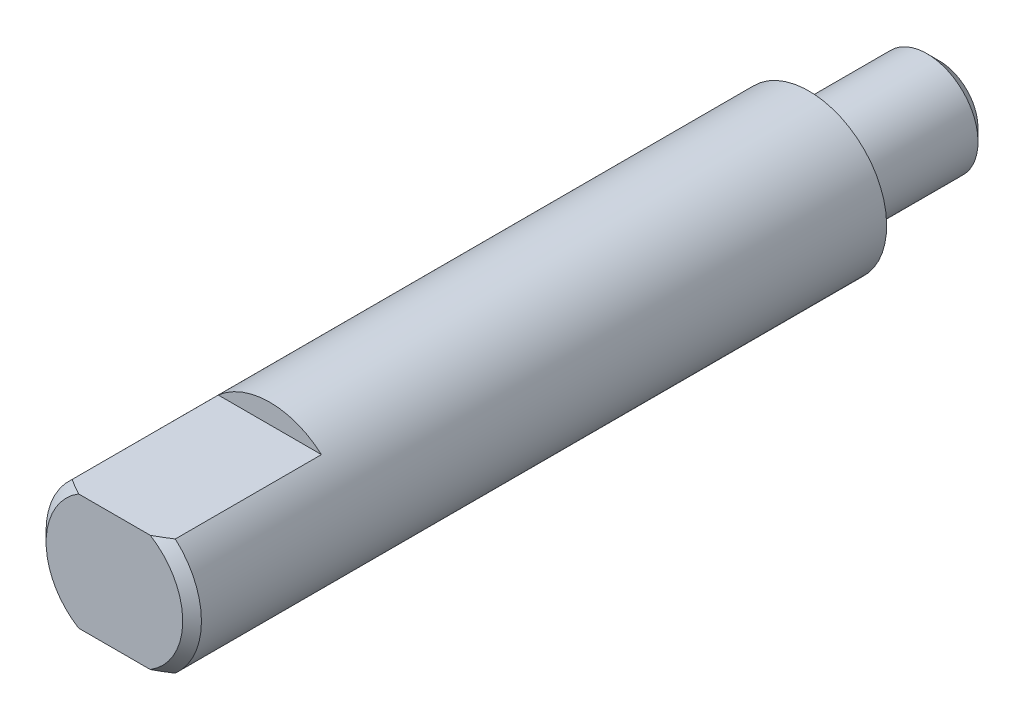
from build123d import *

# Parameters (mm, degrees)
SKETCH2_W          = 6.35
SKETCH2_H          = 0.8
CUT_EXTRUDE1_DEPTH = 5


with BuildPart() as part:
    # Sketch1 → Revolve1 (revolve)
    with BuildSketch(Plane(origin=(0, 0, 0), x_dir=(0, 0, -1), z_dir=(1, 0, 0)), mode=Mode.PRIVATE) as revolve1_sk:
        Polygon((29.6418, 1.57), (29.1318, 2.0828), (24.3078, 2.0828), (24.3078, 3.175), (-3.684, 3.175), (-4.064, 2.79), (-4.064, 0), (29.6418, 0), align=None)
    revolve(revolve1_sk.sketch.rotate(Axis((0, 0, 4.064), (0, 0, -1)), 180), axis=Axis((0, 0, 4.064), (0, 0, -1)))

    # Sketch2 → Cut-Extrude1 (cut, symmetric)
    with BuildSketch(Plane(origin=(0, 0, 0), x_dir=(0, 0, -1), z_dir=(1, 0, 0))):
        with Locations((-0.889, 2.775)):
            Rectangle(SKETCH2_W, SKETCH2_H)
        with Locations((-0.889, -2.775)):
            Rectangle(SKETCH2_W, SKETCH2_H)
    extrude(amount=CUT_EXTRUDE1_DEPTH, both=True, mode=Mode.SUBTRACT)


solid = part.part
